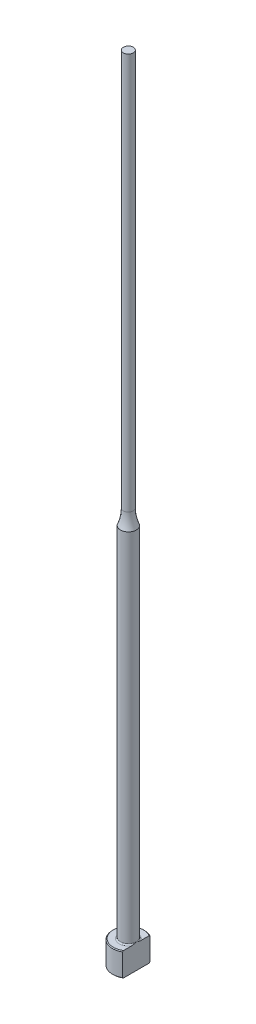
ISO-10303-21;
HEADER;
FILE_DESCRIPTION(('STEP AP214'),'2;1');
FILE_NAME('part.step','',(''),(''),'','','');
FILE_SCHEMA(('AUTOMOTIVE_DESIGN { 1 0 10303 214 1 1 1 1 }'));
ENDSEC;
DATA;
#1=APPLICATION_CONTEXT('core data for automotive mechanical design processes');
#2=APPLICATION_PROTOCOL_DEFINITION('international standard','automotive_design',2000,#1);
#3=PRODUCT_CONTEXT('',#1,'mechanical');
#4=PRODUCT('Part','Part','',(#3));
#5=PRODUCT_RELATED_PRODUCT_CATEGORY('part','',(#4));
#6=PRODUCT_DEFINITION_FORMATION('','',#4);
#7=PRODUCT_DEFINITION_CONTEXT('part definition',#1,'design');
#8=PRODUCT_DEFINITION('design','',#6,#7);
#9=PRODUCT_DEFINITION_SHAPE('','',#8);
#10=(LENGTH_UNIT() NAMED_UNIT(*) SI_UNIT(.MILLI.,.METRE.));
#11=(NAMED_UNIT(*) PLANE_ANGLE_UNIT() SI_UNIT($,.RADIAN.));
#12=(NAMED_UNIT(*) SI_UNIT($,.STERADIAN.) SOLID_ANGLE_UNIT());
#13=UNCERTAINTY_MEASURE_WITH_UNIT(LENGTH_MEASURE(1.E-05),#10,'distance_accuracy_value','');
#14=(GEOMETRIC_REPRESENTATION_CONTEXT(3) GLOBAL_UNCERTAINTY_ASSIGNED_CONTEXT((#13)) GLOBAL_UNIT_ASSIGNED_CONTEXT((#10,
#11,#12)) REPRESENTATION_CONTEXT('',''));
#15=CARTESIAN_POINT('',(0.,0.,0.));
#16=DIRECTION('',(0.,0.,1.));
#17=DIRECTION('',(1.,0.,0.));
#18=AXIS2_PLACEMENT_3D('',#15,#16,#17);
#19=CARTESIAN_POINT('',(-3.99999999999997,6.,0.));
#20=DIRECTION('',(0.,1.,0.));
#21=DIRECTION('',(0.,0.,1.));
#22=AXIS2_PLACEMENT_3D('',#19,#20,#21);
#23=PLANE('',#22);
#24=CARTESIAN_POINT('',(0.,6.,0.));
#25=DIRECTION('',(0.,1.,0.));
#26=DIRECTION('',(0.,0.,1.));
#27=AXIS2_PLACEMENT_3D('',#24,#25,#26);
#28=CIRCLE('',#27,3.80000000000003);
#29=CARTESIAN_POINT('',(1.99999999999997,6.,-3.23109888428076));
#30=VERTEX_POINT('',#29);
#31=CARTESIAN_POINT('',(1.99999999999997,6.,3.23109888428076));
#32=VERTEX_POINT('',#31);
#33=EDGE_CURVE('E187',#30,#32,#28,.T.);
#34=ORIENTED_EDGE('',*,*,#33,.T.);
#35=DIRECTION('',(0.,0.,-1.));
#36=VECTOR('',#35,1.);
#37=CARTESIAN_POINT('',(1.99999999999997,6.,0.));
#38=LINE('',#37,#36);
#39=CARTESIAN_POINT('',(1.99999999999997,5.99999999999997,1.13578166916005));
#40=VERTEX_POINT('',#39);
#41=EDGE_CURVE('E57',#32,#40,#38,.T.);
#42=ORIENTED_EDGE('',*,*,#41,.T.);
#43=CARTESIAN_POINT('',(0.,6.,0.));
#44=DIRECTION('',(0.,1.,0.));
#45=DIRECTION('',(0.,0.,1.));
#46=AXIS2_PLACEMENT_3D('',#43,#44,#45);
#47=CIRCLE('',#46,2.29999999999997);
#48=CARTESIAN_POINT('',(1.99999999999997,5.99999999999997,-1.13578166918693));
#49=VERTEX_POINT('',#48);
#50=EDGE_CURVE('E108',#40,#49,#47,.F.);
#51=ORIENTED_EDGE('',*,*,#50,.T.);
#52=EDGE_CURVE('E137',#49,#30,#38,.T.);
#53=ORIENTED_EDGE('',*,*,#52,.T.);
#54=EDGE_LOOP('',(#34,#42,#51,#53));
#55=FACE_BOUND('',#54,.T.);
#56=ADVANCED_FACE('F32',(#55),#23,.T.);
#57=CARTESIAN_POINT('',(0.,259.958771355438,0.));
#58=DIRECTION('',(0.,1.,0.));
#59=DIRECTION('',(0.,0.,1.));
#60=AXIS2_PLACEMENT_3D('',#57,#58,#59);
#61=CYLINDRICAL_SURFACE('',#60,3.99999999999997);
#62=CARTESIAN_POINT('',(0.,5.80000000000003,0.));
#63=DIRECTION('',(0.,1.,0.));
#64=DIRECTION('',(0.,0.,1.));
#65=AXIS2_PLACEMENT_3D('',#62,#63,#64);
#66=CIRCLE('',#65,3.99999999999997);
#67=CARTESIAN_POINT('',(1.99999999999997,5.80000000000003,3.46410161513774));
#68=VERTEX_POINT('',#67);
#69=CARTESIAN_POINT('',(1.99999999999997,5.80000000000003,-3.46410161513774));
#70=VERTEX_POINT('',#69);
#71=EDGE_CURVE('E105',#68,#70,#66,.F.);
#72=ORIENTED_EDGE('',*,*,#71,.T.);
#73=DIRECTION('',(0.,-1.,0.));
#74=VECTOR('',#73,1.);
#75=CARTESIAN_POINT('',(1.99999999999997,200.,-3.46410161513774));
#76=LINE('',#75,#74);
#77=CARTESIAN_POINT('',(1.99999999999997,0.199999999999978,-3.46410161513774));
#78=VERTEX_POINT('',#77);
#79=EDGE_CURVE('E193',#70,#78,#76,.T.);
#80=ORIENTED_EDGE('',*,*,#79,.T.);
#81=CARTESIAN_POINT('',(0.,0.199999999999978,0.));
#82=DIRECTION('',(0.,-1.,0.));
#83=DIRECTION('',(0.,0.,-1.));
#84=AXIS2_PLACEMENT_3D('',#81,#82,#83);
#85=CIRCLE('',#84,3.99999999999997);
#86=CARTESIAN_POINT('',(1.99999999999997,0.199999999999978,3.46410161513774));
#87=VERTEX_POINT('',#86);
#88=EDGE_CURVE('E100',#78,#87,#85,.F.);
#89=ORIENTED_EDGE('',*,*,#88,.T.);
#90=DIRECTION('',(0.,-1.,0.));
#91=VECTOR('',#90,1.);
#92=CARTESIAN_POINT('',(1.99999999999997,200.,3.46410161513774));
#93=LINE('',#92,#91);
#94=EDGE_CURVE('E93',#68,#87,#93,.T.);
#95=ORIENTED_EDGE('',*,*,#94,.F.);
#96=EDGE_LOOP('',(#72,#80,#89,#95));
#97=FACE_BOUND('',#96,.T.);
#98=ADVANCED_FACE('F158',(#97),#61,.T.);
#99=CARTESIAN_POINT('',(0.,0.,0.));
#100=DIRECTION('',(0.,-1.,0.));
#101=DIRECTION('',(0.,0.,-1.));
#102=AXIS2_PLACEMENT_3D('',#99,#100,#101);
#103=PLANE('',#102);
#104=CARTESIAN_POINT('',(0.,0.,0.));
#105=DIRECTION('',(0.,-1.,0.));
#106=DIRECTION('',(0.,0.,-1.));
#107=AXIS2_PLACEMENT_3D('',#104,#105,#106);
#108=CIRCLE('',#107,3.79999999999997);
#109=CARTESIAN_POINT('',(1.99999999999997,0.,3.23109888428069));
#110=VERTEX_POINT('',#109);
#111=CARTESIAN_POINT('',(1.99999999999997,0.,-3.23109888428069));
#112=VERTEX_POINT('',#111);
#113=EDGE_CURVE('E98',#110,#112,#108,.T.);
#114=ORIENTED_EDGE('',*,*,#113,.T.);
#115=DIRECTION('',(0.,0.,1.));
#116=VECTOR('',#115,1.);
#117=CARTESIAN_POINT('',(1.99999999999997,0.,3.46410161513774));
#118=LINE('',#117,#116);
#119=EDGE_CURVE('E83',#112,#110,#118,.T.);
#120=ORIENTED_EDGE('',*,*,#119,.T.);
#121=EDGE_LOOP('',(#114,#120));
#122=FACE_BOUND('',#121,.T.);
#123=ADVANCED_FACE('F103',(#122),#103,.T.);
#124=CARTESIAN_POINT('',(0.,6.00000000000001,0.));
#125=DIRECTION('',(0.,-1.,0.));
#126=DIRECTION('',(0.,0.,-1.));
#127=AXIS2_PLACEMENT_3D('',#124,#125,#126);
#128=CONICAL_SURFACE('',#127,3.80000000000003,0.785398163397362);
#129=ORIENTED_EDGE('',*,*,#71,.F.);
#130=CARTESIAN_POINT('',(1.99999999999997,1.91904532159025,7.62295524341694));
#131=CARTESIAN_POINT('',(1.99999999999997,2.08611243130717,7.4502239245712));
#132=CARTESIAN_POINT('',(1.99999999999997,2.25300024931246,7.27731861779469));
#133=CARTESIAN_POINT('',(1.99999999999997,2.58631125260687,6.93105655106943));
#134=CARTESIAN_POINT('',(1.99999999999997,2.75273443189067,6.75769978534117));
#135=CARTESIAN_POINT('',(1.99999999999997,3.08509080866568,6.41034692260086));
#136=CARTESIAN_POINT('',(1.99999999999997,3.25102371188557,6.23635054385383));
#137=CARTESIAN_POINT('',(1.99999999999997,3.58215598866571,5.88766284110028));
#138=CARTESIAN_POINT('',(1.99999999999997,3.74735536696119,5.71297152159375));
#139=CARTESIAN_POINT('',(1.99999999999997,4.0735385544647,5.36616839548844));
#140=CARTESIAN_POINT('',(1.99999999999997,4.23454099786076,5.19407412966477));
#141=CARTESIAN_POINT('',(1.99999999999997,4.55534102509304,4.84876663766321));
#142=CARTESIAN_POINT('',(1.99999999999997,4.71513861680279,4.67555341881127));
#143=CARTESIAN_POINT('',(1.99999999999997,5.0330618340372,4.32766569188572));
#144=CARTESIAN_POINT('',(1.99999999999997,5.191187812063,4.15299150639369));
#145=CARTESIAN_POINT('',(1.99999999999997,5.50513944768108,3.80159134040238));
#146=CARTESIAN_POINT('',(1.99999999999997,5.66096519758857,3.62486544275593));
#147=CARTESIAN_POINT('',(1.99999999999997,5.90974646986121,3.33722425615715));
#148=CARTESIAN_POINT('',(1.99999999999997,6.00376148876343,3.22722645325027));
#149=CARTESIAN_POINT('',(1.99999999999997,6.19011825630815,3.00579987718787));
#150=CARTESIAN_POINT('',(1.99999999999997,6.28245983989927,2.89437096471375));
#151=CARTESIAN_POINT('',(1.99999999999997,6.46586188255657,2.66849662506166));
#152=CARTESIAN_POINT('',(1.99999999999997,6.55689849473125,2.55403176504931));
#153=CARTESIAN_POINT('',(1.99999999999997,6.73578809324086,2.32266819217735));
#154=CARTESIAN_POINT('',(1.99999999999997,6.82364184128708,2.20577007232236));
#155=CARTESIAN_POINT('',(1.99999999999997,6.99612756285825,1.96688707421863));
#156=CARTESIAN_POINT('',(1.99999999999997,7.08069035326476,1.84485190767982));
#157=CARTESIAN_POINT('',(1.99999999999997,7.2430026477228,1.59599329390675));
#158=CARTESIAN_POINT('',(1.99999999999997,7.32074277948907,1.46916359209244));
#159=CARTESIAN_POINT('',(1.99999999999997,7.42869763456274,1.27510066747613));
#160=CARTESIAN_POINT('',(1.99999999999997,7.46305374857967,1.21018943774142));
#161=CARTESIAN_POINT('',(1.99999999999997,7.52837146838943,1.07868835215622));
#162=CARTESIAN_POINT('',(1.99999999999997,7.55933245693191,1.01209819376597));
#163=CARTESIAN_POINT('',(1.99999999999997,7.64566860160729,0.8098943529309));
#164=CARTESIAN_POINT('',(1.99999999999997,7.69478214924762,0.671360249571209));
#165=CARTESIAN_POINT('',(1.99999999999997,7.74794829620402,0.463657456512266));
#166=CARTESIAN_POINT('',(1.99999999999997,7.76205065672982,0.397033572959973));
#167=CARTESIAN_POINT('',(1.99999999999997,7.78390371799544,0.26272845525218));
#168=CARTESIAN_POINT('',(1.99999999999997,7.79165498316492,0.19504731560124));
#169=CARTESIAN_POINT('',(1.99999999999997,7.80025690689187,0.0594528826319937));
#170=CARTESIAN_POINT('',(1.99999999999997,7.80112894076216,-0.00845903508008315));
#171=CARTESIAN_POINT('',(1.99999999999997,7.79596585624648,-0.144020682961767));
#172=CARTESIAN_POINT('',(1.99999999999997,7.78993016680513,-0.211670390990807));
#173=CARTESIAN_POINT('',(1.99999999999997,7.77145363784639,-0.345483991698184));
#174=CARTESIAN_POINT('',(1.99999999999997,7.7590677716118,-0.411655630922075));
#175=CARTESIAN_POINT('',(1.99999999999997,7.72866360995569,-0.542678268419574));
#176=CARTESIAN_POINT('',(1.99999999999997,7.71064463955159,-0.607529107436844));
#177=CARTESIAN_POINT('',(1.99999999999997,7.669729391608,-0.736064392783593));
#178=CARTESIAN_POINT('',(1.99999999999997,7.64680564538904,-0.79973998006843));
#179=CARTESIAN_POINT('',(1.99999999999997,7.59700147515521,-0.925489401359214));
#180=CARTESIAN_POINT('',(1.99999999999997,7.57012185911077,-0.98756355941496));
#181=CARTESIAN_POINT('',(1.99999999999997,7.48443518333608,-1.17209020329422));
#182=CARTESIAN_POINT('',(1.99999999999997,7.42077407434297,-1.29228210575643));
#183=CARTESIAN_POINT('',(1.99999999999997,7.28502644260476,-1.52785770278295));
#184=CARTESIAN_POINT('',(1.99999999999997,7.21292931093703,-1.6432350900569));
#185=CARTESIAN_POINT('',(1.99999999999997,7.06281517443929,-1.8706938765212));
#186=CARTESIAN_POINT('',(1.99999999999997,6.98477595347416,-1.98276048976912));
#187=CARTESIAN_POINT('',(1.99999999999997,6.8248197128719,-2.20397837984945));
#188=CARTESIAN_POINT('',(1.99999999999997,6.74290465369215,-2.31313108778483));
#189=CARTESIAN_POINT('',(1.99999999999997,6.57517222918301,-2.5306854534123));
#190=CARTESIAN_POINT('',(1.99999999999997,6.4893176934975,-2.63905831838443));
#191=CARTESIAN_POINT('',(1.99999999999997,6.31548151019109,-2.85409686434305));
#192=CARTESIAN_POINT('',(1.99999999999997,6.22749963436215,-2.96076236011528));
#193=CARTESIAN_POINT('',(1.99999999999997,6.05015030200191,-3.17249211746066));
#194=CARTESIAN_POINT('',(1.99999999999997,5.96078672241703,-3.27755963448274));
#195=CARTESIAN_POINT('',(1.99999999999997,5.78082366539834,-3.48663191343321));
#196=CARTESIAN_POINT('',(1.99999999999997,5.69022416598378,-3.59063665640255));
#197=CARTESIAN_POINT('',(1.99999999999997,5.44796733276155,-3.86612439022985));
#198=CARTESIAN_POINT('',(1.99999999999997,5.29545972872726,-4.03685912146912));
#199=CARTESIAN_POINT('',(1.99999999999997,4.98858070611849,-4.37664803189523));
#200=CARTESIAN_POINT('',(1.99999999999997,4.83420923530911,-4.54570216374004));
#201=CARTESIAN_POINT('',(1.99999999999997,4.52396102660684,-4.88271638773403));
#202=CARTESIAN_POINT('',(1.99999999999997,4.36808300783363,-5.05067529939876));
#203=CARTESIAN_POINT('',(1.99999999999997,4.05530513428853,-5.38563883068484));
#204=CARTESIAN_POINT('',(1.99999999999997,3.8984052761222,-5.55264344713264));
#205=CARTESIAN_POINT('',(1.99999999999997,3.59029018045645,-5.87905385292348));
#206=CARTESIAN_POINT('',(1.99999999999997,3.43910664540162,-6.03848959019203));
#207=CARTESIAN_POINT('',(1.99999999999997,3.13616436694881,-6.35681456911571));
#208=CARTESIAN_POINT('',(1.99999999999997,2.98440562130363,-6.5157038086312));
#209=CARTESIAN_POINT('',(1.99999999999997,2.68059501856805,-6.83286192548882));
#210=CARTESIAN_POINT('',(1.99999999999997,2.52854367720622,-6.99113129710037));
#211=CARTESIAN_POINT('',(1.99999999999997,2.22406035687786,-7.30730102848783));
#212=CARTESIAN_POINT('',(1.99999999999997,2.07162838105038,-7.46520139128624));
#213=CARTESIAN_POINT('',(1.99999999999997,1.91904532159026,-7.62295524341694));
#214=B_SPLINE_CURVE_WITH_KNOTS('',3,(#130,#131,#132,#133,#134,#135,#136,#137,#138,#139,#140,
#141,#142,#143,#144,#145,#146,#147,#148,#149,#150,#151,#152,#153,#154,#155,#156,#157,#158,#159,
#160,#161,#162,#163,#164,#165,#166,#167,#168,#169,#170,#171,#172,#173,#174,#175,#176,#177,#178,
#179,#180,#181,#182,#183,#184,#185,#186,#187,#188,#189,#190,#191,#192,#193,#194,#195,#196,#197,
#198,#199,#200,#201,#202,#203,#204,#205,#206,#207,#208,#209,#210,#211,#212,#213),.UNSPECIFIED.,
.F.,.F.,(4,2,2,2,2,2,2,2,2,2,2,2,2,2,2,2,2,2,2,2,2,2,2,2,2,2,2,2,2,2,2,2,2,2,2,2,2,2,2,2,2,4),
(0.,0.720921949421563,1.4418531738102,2.16315326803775,2.8844486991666,3.59144103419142,
4.29842874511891,5.00526427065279,5.7120713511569,6.14616174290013,6.58029471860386,
7.01901494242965,7.45762947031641,7.90290456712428,8.34878206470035,8.56901415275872,
8.78928621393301,9.228144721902,9.43219512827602,9.63622739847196,9.83962544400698,
10.0430403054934,10.244723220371,10.4464303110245,10.6492980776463,10.8521244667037,
11.2595582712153,11.6675100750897,12.0770700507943,12.4864250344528,12.9011677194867,
13.3159550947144,13.7297367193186,14.1435257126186,14.8302935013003,15.5170805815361,
16.2045145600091,16.891950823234,17.5511045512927,18.2102608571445,18.8686819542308,
19.5270976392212),.UNSPECIFIED.);
#215=EDGE_CURVE('E136',#68,#32,#214,.T.);
#216=ORIENTED_EDGE('',*,*,#215,.T.);
#217=ORIENTED_EDGE('',*,*,#33,.F.);
#218=EDGE_CURVE('E128',#30,#70,#214,.T.);
#219=ORIENTED_EDGE('',*,*,#218,.T.);
#220=EDGE_LOOP('',(#129,#216,#217,#219));
#221=FACE_BOUND('',#220,.T.);
#222=ADVANCED_FACE('F144',(#221),#128,.T.);
#223=CARTESIAN_POINT('',(0.,0.199999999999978,0.));
#224=DIRECTION('',(0.,1.,0.));
#225=DIRECTION('',(0.,0.,1.));
#226=AXIS2_PLACEMENT_3D('',#223,#224,#225);
#227=CONICAL_SURFACE('',#226,3.99999999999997,0.7853981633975);
#228=ORIENTED_EDGE('',*,*,#88,.F.);
#229=CARTESIAN_POINT('',(1.99999999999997,4.08095467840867,-7.62295524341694));
#230=CARTESIAN_POINT('',(1.99999999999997,3.91388756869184,-7.45022392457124));
#231=CARTESIAN_POINT('',(1.99999999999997,3.74699975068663,-7.27731861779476));
#232=CARTESIAN_POINT('',(1.99999999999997,3.41368874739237,-6.93105655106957));
#233=CARTESIAN_POINT('',(1.99999999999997,3.24726556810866,-6.75769978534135));
#234=CARTESIAN_POINT('',(1.99999999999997,2.91490919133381,-6.4103469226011));
#235=CARTESIAN_POINT('',(1.99999999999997,2.74897628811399,-6.23635054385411));
#236=CARTESIAN_POINT('',(1.99999999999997,2.41784401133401,-5.88766284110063));
#237=CARTESIAN_POINT('',(1.99999999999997,2.25264463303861,-5.71297152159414));
#238=CARTESIAN_POINT('',(1.99999999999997,1.92646144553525,-5.3661683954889));
#239=CARTESIAN_POINT('',(1.99999999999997,1.76545900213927,-5.19407412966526));
#240=CARTESIAN_POINT('',(1.99999999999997,1.44465897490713,-4.84876663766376));
#241=CARTESIAN_POINT('',(1.99999999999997,1.28486138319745,-4.67555341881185));
#242=CARTESIAN_POINT('',(1.99999999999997,0.966938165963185,-4.32766569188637));
#243=CARTESIAN_POINT('',(1.99999999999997,0.80881218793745,-4.15299150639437));
#244=CARTESIAN_POINT('',(1.99999999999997,0.494860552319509,-3.80159134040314));
#245=CARTESIAN_POINT('',(1.99999999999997,0.339034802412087,-3.62486544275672));
#246=CARTESIAN_POINT('',(1.99999999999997,0.0902535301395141,-3.33722425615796));
#247=CARTESIAN_POINT('',(1.99999999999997,-0.0037614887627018,-3.22722645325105));
#248=CARTESIAN_POINT('',(1.99999999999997,-0.190118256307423,-3.0057998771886));
#249=CARTESIAN_POINT('',(1.99999999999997,-0.282459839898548,-2.89437096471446));
#250=CARTESIAN_POINT('',(1.99999999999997,-0.465861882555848,-2.66849662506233));
#251=CARTESIAN_POINT('',(1.99999999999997,-0.556898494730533,-2.55403176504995));
#252=CARTESIAN_POINT('',(1.99999999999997,-0.735788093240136,-2.32266819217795));
#253=CARTESIAN_POINT('',(1.99999999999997,-0.823641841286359,-2.20577007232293));
#254=CARTESIAN_POINT('',(1.99999999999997,-0.996127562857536,-1.96688707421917));
#255=CARTESIAN_POINT('',(1.99999999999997,-1.08069035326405,-1.84485190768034));
#256=CARTESIAN_POINT('',(1.99999999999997,-1.2430026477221,-1.59599329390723));
#257=CARTESIAN_POINT('',(1.99999999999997,-1.32074277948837,-1.4691635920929));
#258=CARTESIAN_POINT('',(1.99999999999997,-1.42869763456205,-1.27510066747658));
#259=CARTESIAN_POINT('',(1.99999999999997,-1.46305374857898,-1.21018943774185));
#260=CARTESIAN_POINT('',(1.99999999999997,-1.52837146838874,-1.07868835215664));
#261=CARTESIAN_POINT('',(1.99999999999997,-1.55933245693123,-1.01209819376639));
#262=CARTESIAN_POINT('',(1.99999999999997,-1.64566860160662,-0.809894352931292));
#263=CARTESIAN_POINT('',(1.99999999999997,-1.69478214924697,-0.671360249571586));
#264=CARTESIAN_POINT('',(1.99999999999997,-1.74794829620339,-0.463657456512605));
#265=CARTESIAN_POINT('',(1.99999999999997,-1.76205065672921,-0.397033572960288));
#266=CARTESIAN_POINT('',(1.99999999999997,-1.78390371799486,-0.262728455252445));
#267=CARTESIAN_POINT('',(1.99999999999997,-1.79165498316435,-0.19504731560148));
#268=CARTESIAN_POINT('',(1.99999999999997,-1.80025690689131,-0.059452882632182));
#269=CARTESIAN_POINT('',(1.99999999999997,-1.8011289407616,0.00845903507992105));
#270=CARTESIAN_POINT('',(1.99999999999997,-1.79596585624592,0.144020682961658));
#271=CARTESIAN_POINT('',(1.99999999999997,-1.78993016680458,0.211670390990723));
#272=CARTESIAN_POINT('',(1.99999999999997,-1.77145363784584,0.345483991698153));
#273=CARTESIAN_POINT('',(1.99999999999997,-1.75906777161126,0.411655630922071));
#274=CARTESIAN_POINT('',(1.99999999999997,-1.72866360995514,0.542678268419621));
#275=CARTESIAN_POINT('',(1.99999999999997,-1.71064463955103,0.607529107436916));
#276=CARTESIAN_POINT('',(1.99999999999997,-1.66972939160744,0.736064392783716));
#277=CARTESIAN_POINT('',(1.99999999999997,-1.64680564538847,0.799739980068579));
#278=CARTESIAN_POINT('',(1.99999999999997,-1.59700147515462,0.925489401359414));
#279=CARTESIAN_POINT('',(1.99999999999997,-1.57012185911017,0.987563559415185));
#280=CARTESIAN_POINT('',(1.99999999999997,-1.48443518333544,1.17209020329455));
#281=CARTESIAN_POINT('',(1.99999999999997,-1.4207740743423,1.29228210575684));
#282=CARTESIAN_POINT('',(1.99999999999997,-1.28502644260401,1.52785770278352));
#283=CARTESIAN_POINT('',(1.99999999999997,-1.21292931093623,1.64323509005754));
#284=CARTESIAN_POINT('',(1.99999999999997,-1.0628151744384,1.87069387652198));
#285=CARTESIAN_POINT('',(1.99999999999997,-0.984775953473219,1.98276048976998));
#286=CARTESIAN_POINT('',(1.99999999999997,-0.82481971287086,2.20397837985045));
#287=CARTESIAN_POINT('',(1.99999999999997,-0.742904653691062,2.31313108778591));
#288=CARTESIAN_POINT('',(1.99999999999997,-0.575172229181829,2.53068545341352));
#289=CARTESIAN_POINT('',(1.99999999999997,-0.489317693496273,2.63905831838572));
#290=CARTESIAN_POINT('',(1.99999999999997,-0.315481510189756,2.85409686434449));
#291=CARTESIAN_POINT('',(1.99999999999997,-0.227499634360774,2.9607623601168));
#292=CARTESIAN_POINT('',(1.99999999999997,-0.0501503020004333,3.17249211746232));
#293=CARTESIAN_POINT('',(1.99999999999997,0.0392132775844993,3.27755963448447));
#294=CARTESIAN_POINT('',(1.99999999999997,0.219176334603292,3.48663191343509));
#295=CARTESIAN_POINT('',(1.99999999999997,0.309775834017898,3.59063665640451));
#296=CARTESIAN_POINT('',(1.99999999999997,0.552032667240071,3.86612439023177));
#297=CARTESIAN_POINT('',(1.99999999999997,0.704540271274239,4.03685912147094));
#298=CARTESIAN_POINT('',(1.99999999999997,1.01141929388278,4.37664803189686));
#299=CARTESIAN_POINT('',(1.99999999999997,1.16579076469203,4.54570216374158));
#300=CARTESIAN_POINT('',(1.99999999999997,1.47603897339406,4.88271638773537));
#301=CARTESIAN_POINT('',(1.99999999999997,1.63191699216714,5.05067529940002));
#302=CARTESIAN_POINT('',(1.99999999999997,1.94469486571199,5.38563883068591));
#303=CARTESIAN_POINT('',(1.99999999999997,2.10159472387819,5.55264344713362));
#304=CARTESIAN_POINT('',(1.99999999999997,2.40970981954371,5.87905385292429));
#305=CARTESIAN_POINT('',(1.99999999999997,2.56089335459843,6.03848959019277));
#306=CARTESIAN_POINT('',(1.99999999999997,2.86383563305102,6.3568145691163));
#307=CARTESIAN_POINT('',(1.99999999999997,3.01559437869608,6.51570380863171));
#308=CARTESIAN_POINT('',(1.99999999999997,3.31940498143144,6.83286192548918));
#309=CARTESIAN_POINT('',(1.99999999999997,3.47145632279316,6.99113129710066));
#310=CARTESIAN_POINT('',(1.99999999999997,3.77593964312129,7.30730102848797));
#311=CARTESIAN_POINT('',(1.99999999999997,3.92837161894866,7.46520139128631));
#312=CARTESIAN_POINT('',(1.99999999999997,4.08095467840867,7.62295524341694));
#313=B_SPLINE_CURVE_WITH_KNOTS('',3,(#229,#230,#231,#232,#233,#234,#235,#236,#237,#238,#239,
#240,#241,#242,#243,#244,#245,#246,#247,#248,#249,#250,#251,#252,#253,#254,#255,#256,#257,#258,
#259,#260,#261,#262,#263,#264,#265,#266,#267,#268,#269,#270,#271,#272,#273,#274,#275,#276,#277,
#278,#279,#280,#281,#282,#283,#284,#285,#286,#287,#288,#289,#290,#291,#292,#293,#294,#295,#296,
#297,#298,#299,#300,#301,#302,#303,#304,#305,#306,#307,#308,#309,#310,#311,#312),.UNSPECIFIED.,
.F.,.F.,(4,2,2,2,2,2,2,2,2,2,2,2,2,2,2,2,2,2,2,2,2,2,2,2,2,2,2,2,2,2,2,2,2,2,2,2,2,2,2,2,2,4),
(0.,0.720921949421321,1.44185317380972,2.16315326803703,2.88444869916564,3.59144103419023,
4.29842874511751,5.00526427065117,5.71207135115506,6.14616174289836,6.58029471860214,
7.01901494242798,7.45762947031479,7.90290456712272,8.34878206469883,8.56901415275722,
8.78928621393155,9.22814472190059,9.43219512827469,9.63622739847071,9.8396254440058,
10.0430403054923,10.24472322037,10.4464303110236,10.6492980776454,10.8521244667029,
11.2595582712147,11.6675100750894,12.0770700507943,12.4864250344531,12.9011677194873,
13.3159550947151,13.7297367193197,14.1435257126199,14.8302935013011,15.5170805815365,
16.204514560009,16.8919508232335,17.5511045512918,18.2102608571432,18.8686819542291,
19.5270976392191),.UNSPECIFIED.);
#314=EDGE_CURVE('E86',#78,#112,#313,.T.);
#315=ORIENTED_EDGE('',*,*,#314,.T.);
#316=ORIENTED_EDGE('',*,*,#113,.F.);
#317=EDGE_CURVE('E89',#110,#87,#313,.T.);
#318=ORIENTED_EDGE('',*,*,#317,.T.);
#319=EDGE_LOOP('',(#228,#315,#316,#318));
#320=FACE_BOUND('',#319,.T.);
#321=ADVANCED_FACE('F97',(#320),#227,.T.);
#322=CARTESIAN_POINT('',(0.,6.29999999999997,0.));
#323=DIRECTION('',(0.,1.,0.));
#324=DIRECTION('',(0.,0.,1.));
#325=AXIS2_PLACEMENT_3D('',#322,#323,#324);
#326=TOROIDAL_SURFACE('',#325,2.29999999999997,0.3);
#327=CARTESIAN_POINT('',(1.99999999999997,6.29999999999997,0.));
#328=CARTESIAN_POINT('',(1.99999999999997,6.30000062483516,-7.91120119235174E-11));
#329=CARTESIAN_POINT('',(1.99999999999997,6.3000012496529,-1.38466953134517E-07));
#330=CARTESIAN_POINT('',(1.99999999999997,6.3000024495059,-5.72507056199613E-07));
#331=CARTESIAN_POINT('',(1.99999999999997,6.30000302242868,-8.72848936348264E-07));
#332=CARTESIAN_POINT('',(1.99999999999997,6.30000416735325,-1.59335938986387E-06));
#333=CARTESIAN_POINT('',(1.99999999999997,6.30000473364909,-2.02244692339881E-06));
#334=CARTESIAN_POINT('',(1.99999999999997,6.30000579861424,-2.94494844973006E-06));
#335=CARTESIAN_POINT('',(1.99999999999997,6.30000629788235,-3.4377030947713E-06));
#336=CARTESIAN_POINT('',(1.99999999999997,6.30000798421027,-5.21460072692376E-06));
#337=CARTESIAN_POINT('',(1.99999999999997,6.30000908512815,-6.58180911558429E-06));
#338=CARTESIAN_POINT('',(1.99999999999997,6.30001103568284,-9.3977532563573E-06));
#339=CARTESIAN_POINT('',(1.99999999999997,6.30001189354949,-1.08411101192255E-05));
#340=CARTESIAN_POINT('',(1.99999999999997,6.30001514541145,-1.65122775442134E-05));
#341=CARTESIAN_POINT('',(1.99999999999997,6.30001737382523,-2.08398783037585E-05));
#342=CARTESIAN_POINT('',(1.99999999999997,6.30002099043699,-2.93440763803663E-05));
#343=CARTESIAN_POINT('',(1.99999999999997,6.30002243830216,-3.34960297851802E-05));
#344=CARTESIAN_POINT('',(1.99999999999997,6.30002863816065,-5.12890573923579E-05));
#345=CARTESIAN_POINT('',(1.99999999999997,6.30003337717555,-6.49250938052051E-05));
#346=CARTESIAN_POINT('',(1.99999999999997,6.30004093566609,-9.03829827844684E-05));
#347=CARTESIAN_POINT('',(1.99999999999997,6.30004394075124,-0.000102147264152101));
#348=CARTESIAN_POINT('',(1.99999999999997,6.30006787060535,-0.000188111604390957));
#349=CARTESIAN_POINT('',(1.99999999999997,6.3000985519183,-0.000259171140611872));
#350=CARTESIAN_POINT('',(1.99999999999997,6.30021378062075,-0.00053614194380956));
#351=CARTESIAN_POINT('',(1.99999999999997,6.3002910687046,-0.000744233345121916));
#352=CARTESIAN_POINT('',(1.99999999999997,6.30059644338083,-0.00155446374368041));
#353=CARTESIAN_POINT('',(1.99999999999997,6.30083214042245,-0.00215436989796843));
#354=CARTESIAN_POINT('',(1.99999999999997,6.30179425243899,-0.00461477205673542));
#355=CARTESIAN_POINT('',(1.99999999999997,6.30251207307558,-0.00647773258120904));
#356=CARTESIAN_POINT('',(1.99999999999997,6.31311632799,-0.0339840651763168));
#357=CARTESIAN_POINT('',(1.99999999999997,6.32306890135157,-0.0596088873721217));
#358=CARTESIAN_POINT('',(1.99999999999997,6.34248629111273,-0.109946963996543));
#359=CARTESIAN_POINT('',(1.99999999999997,6.35195547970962,-0.134658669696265));
#360=CARTESIAN_POINT('',(1.99999999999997,6.37186796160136,-0.18704653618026));
#361=CARTESIAN_POINT('',(1.99999999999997,6.38229466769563,-0.214729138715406));
#362=CARTESIAN_POINT('',(1.99999999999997,6.40297705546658,-0.270480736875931));
#363=CARTESIAN_POINT('',(1.99999999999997,6.41322989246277,-0.298550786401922));
#364=CARTESIAN_POINT('',(1.99999999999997,6.43806738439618,-0.36800773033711));
#365=CARTESIAN_POINT('',(1.99999999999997,6.45243182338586,-0.409474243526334));
#366=CARTESIAN_POINT('',(1.99999999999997,6.47965482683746,-0.491807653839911));
#367=CARTESIAN_POINT('',(1.99999999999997,6.49254110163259,-0.532665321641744));
#368=CARTESIAN_POINT('',(1.99999999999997,6.51851192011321,-0.620554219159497));
#369=CARTESIAN_POINT('',(1.99999999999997,6.53137383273,-0.667652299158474));
#370=CARTESIAN_POINT('',(1.99999999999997,6.55459547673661,-0.762854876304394));
#371=CARTESIAN_POINT('',(1.99999999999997,6.5649353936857,-0.810964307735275));
#372=CARTESIAN_POINT('',(1.99999999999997,6.58270957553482,-0.910933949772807));
#373=CARTESIAN_POINT('',(1.99999999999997,6.58991426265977,-0.962836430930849));
#374=CARTESIAN_POINT('',(1.99999999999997,6.59906919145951,-1.06698400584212));
#375=CARTESIAN_POINT('',(1.99999999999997,6.60103790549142,-1.1192272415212));
#376=CARTESIAN_POINT('',(1.99999999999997,6.59819318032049,-1.21399009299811));
#377=CARTESIAN_POINT('',(1.99999999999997,6.59455548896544,-1.2565387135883));
#378=CARTESIAN_POINT('',(1.99999999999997,6.58116512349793,-1.34017723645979));
#379=CARTESIAN_POINT('',(1.99999999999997,6.57150205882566,-1.38127935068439));
#380=CARTESIAN_POINT('',(1.99999999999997,6.55087659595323,-1.44109771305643));
#381=CARTESIAN_POINT('',(1.99999999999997,6.5429124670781,-1.46084510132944));
#382=CARTESIAN_POINT('',(1.99999999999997,6.52453399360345,-1.49924523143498));
#383=CARTESIAN_POINT('',(1.99999999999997,6.51411538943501,-1.51789599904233));
#384=CARTESIAN_POINT('',(1.99999999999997,6.49255299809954,-1.55022658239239));
#385=CARTESIAN_POINT('',(1.99999999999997,6.48185951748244,-1.56420357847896));
#386=CARTESIAN_POINT('',(1.99999999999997,6.45839348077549,-1.5902875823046));
#387=CARTESIAN_POINT('',(1.99999999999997,6.445625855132,-1.60239889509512));
#388=CARTESIAN_POINT('',(1.99999999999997,6.4218327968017,-1.62093425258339));
#389=CARTESIAN_POINT('',(1.99999999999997,6.41131183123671,-1.6280029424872));
#390=CARTESIAN_POINT('',(1.99999999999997,6.38926242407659,-1.64036132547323));
#391=CARTESIAN_POINT('',(1.99999999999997,6.37773458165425,-1.64565206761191));
#392=CARTESIAN_POINT('',(1.99999999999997,6.35379760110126,-1.65410966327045));
#393=CARTESIAN_POINT('',(1.99999999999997,6.34138166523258,-1.65725762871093));
#394=CARTESIAN_POINT('',(1.99999999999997,6.31617371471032,-1.66106000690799));
#395=CARTESIAN_POINT('',(1.99999999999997,6.3033820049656,-1.66171638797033));
#396=CARTESIAN_POINT('',(1.99999999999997,6.27959278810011,-1.66055848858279));
#397=CARTESIAN_POINT('',(1.99999999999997,6.26857876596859,-1.6590551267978));
#398=CARTESIAN_POINT('',(1.99999999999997,6.24695777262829,-1.65423593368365));
#399=CARTESIAN_POINT('',(1.99999999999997,6.23635086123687,-1.65091983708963));
#400=CARTESIAN_POINT('',(1.99999999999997,6.21566894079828,-1.64264699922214));
#401=CARTESIAN_POINT('',(1.99999999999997,6.20560117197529,-1.63767239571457));
#402=CARTESIAN_POINT('',(1.99999999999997,6.18626855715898,-1.626364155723));
#403=CARTESIAN_POINT('',(1.99999999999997,6.17700400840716,-1.62003001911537));
#404=CARTESIAN_POINT('',(1.99999999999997,6.15429988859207,-1.60233802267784));
#405=CARTESIAN_POINT('',(1.99999999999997,6.14148777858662,-1.59017362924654));
#406=CARTESIAN_POINT('',(1.99999999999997,6.11794267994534,-1.56396532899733));
#407=CARTESIAN_POINT('',(1.99999999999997,6.10721625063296,-1.54991572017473));
#408=CARTESIAN_POINT('',(1.99999999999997,6.08234423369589,-1.51253200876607));
#409=CARTESIAN_POINT('',(1.99999999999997,6.06952968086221,-1.48831711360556));
#410=CARTESIAN_POINT('',(1.99999999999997,6.04773953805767,-1.43832020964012));
#411=CARTESIAN_POINT('',(1.99999999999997,6.03876197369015,-1.41253901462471));
#412=CARTESIAN_POINT('',(1.99999999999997,6.01850750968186,-1.3410181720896));
#413=CARTESIAN_POINT('',(1.99999999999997,6.01031623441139,-1.29441496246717));
#414=CARTESIAN_POINT('',(1.99999999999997,6.00061264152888,-1.19993212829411));
#415=CARTESIAN_POINT('',(1.99999999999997,5.99920833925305,-1.15204398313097));
#416=CARTESIAN_POINT('',(1.99999999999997,6.001930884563,-1.04246961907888));
#417=CARTESIAN_POINT('',(1.99999999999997,6.00779200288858,-0.980836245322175));
#418=CARTESIAN_POINT('',(1.99999999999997,6.0256292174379,-0.858294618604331));
#419=CARTESIAN_POINT('',(1.99999999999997,6.03763032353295,-0.797390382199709));
#420=CARTESIAN_POINT('',(1.99999999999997,6.0649490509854,-0.681046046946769));
#421=CARTESIAN_POINT('',(1.99999999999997,6.07996031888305,-0.625531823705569));
#422=CARTESIAN_POINT('',(1.99999999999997,6.11250087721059,-0.515805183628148));
#423=CARTESIAN_POINT('',(1.99999999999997,6.13000629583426,-0.461585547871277));
#424=CARTESIAN_POINT('',(1.99999999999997,6.15814737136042,-0.379074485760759));
#425=CARTESIAN_POINT('',(1.99999999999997,6.16814918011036,-0.350562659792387));
#426=CARTESIAN_POINT('',(1.99999999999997,6.18879761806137,-0.29295407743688));
#427=CARTESIAN_POINT('',(1.99999999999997,6.19945417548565,-0.263860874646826));
#428=CARTESIAN_POINT('',(1.99999999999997,6.21767622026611,-0.214869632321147));
#429=CARTESIAN_POINT('',(1.99999999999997,6.22516548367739,-0.19494302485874));
#430=CARTESIAN_POINT('',(1.99999999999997,6.24017206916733,-0.155327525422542));
#431=CARTESIAN_POINT('',(1.99999999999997,6.24768836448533,-0.135638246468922));
#432=CARTESIAN_POINT('',(1.99999999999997,6.26198776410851,-0.0983447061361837));
#433=CARTESIAN_POINT('',(1.99999999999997,6.26876515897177,-0.0807381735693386));
#434=CARTESIAN_POINT('',(1.99999999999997,6.2826325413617,-0.0448719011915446));
#435=CARTESIAN_POINT('',(1.99999999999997,6.28972459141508,-0.0266128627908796));
#436=CARTESIAN_POINT('',(1.99999999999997,6.29748742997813,-0.0064792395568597));
#437=CARTESIAN_POINT('',(1.99999999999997,6.29820461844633,-0.00461774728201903));
#438=CARTESIAN_POINT('',(1.99999999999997,6.29916656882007,-0.00215769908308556));
#439=CARTESIAN_POINT('',(1.99999999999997,6.29940270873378,-0.0015566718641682));
#440=CARTESIAN_POINT('',(1.99999999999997,6.29970861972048,-0.000745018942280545));
#441=CARTESIAN_POINT('',(1.99999999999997,6.29978601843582,-0.000536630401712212));
#442=CARTESIAN_POINT('',(1.99999999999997,6.29990139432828,-0.000259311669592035));
#443=CARTESIAN_POINT('',(1.99999999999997,6.29993209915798,-0.000188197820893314));
#444=CARTESIAN_POINT('',(1.99999999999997,6.29995604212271,-0.00010217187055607));
#445=CARTESIAN_POINT('',(1.99999999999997,6.29995904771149,-9.04035945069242E-05));
#446=CARTESIAN_POINT('',(1.99999999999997,6.29996660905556,-6.49368762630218E-05));
#447=CARTESIAN_POINT('',(1.99999999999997,6.2999713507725,-5.12961131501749E-05));
#448=CARTESIAN_POINT('',(1.99999999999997,6.29997755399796,-3.34977849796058E-05));
#449=CARTESIAN_POINT('',(1.99999999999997,6.29997900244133,-2.93452179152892E-05));
#450=CARTESIAN_POINT('',(1.99999999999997,6.29998262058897,-2.08398568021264E-05));
#451=CARTESIAN_POINT('',(1.99999999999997,6.2999848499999,-1.65117298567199E-05));
#452=CARTESIAN_POINT('',(1.99999999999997,6.29998810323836,-1.08400636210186E-05));
#453=CARTESIAN_POINT('',(1.99999999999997,6.29998896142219,-9.39665904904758E-06));
#454=CARTESIAN_POINT('',(1.99999999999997,6.29999091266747,-6.58068188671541E-06));
#455=CARTESIAN_POINT('',(1.99999999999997,6.29999201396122,-5.21349162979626E-06));
#456=CARTESIAN_POINT('',(1.99999999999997,6.29999370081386,-3.43669337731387E-06));
#457=CARTESIAN_POINT('',(1.99999999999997,6.29999420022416,-2.94398228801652E-06));
#458=CARTESIAN_POINT('',(1.99999999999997,6.29999526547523,-2.02159337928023E-06));
#459=CARTESIAN_POINT('',(1.99999999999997,6.29999583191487,-1.59257522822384E-06));
#460=CARTESIAN_POINT('',(1.99999999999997,6.29999697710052,-8.72232367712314E-07));
#461=CARTESIAN_POINT('',(1.99999999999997,6.29999755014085,-5.71985037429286E-07));
#462=CARTESIAN_POINT('',(1.99999999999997,6.29999875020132,-1.38175023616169E-07));
#463=CARTESIAN_POINT('',(1.99999999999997,6.29999937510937,7.91190278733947E-11));
#464=CARTESIAN_POINT('',(1.99999999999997,6.29999999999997,0.));
#465=B_SPLINE_CURVE_WITH_KNOTS('',3,(#327,#328,#329,#330,#331,#332,#333,#334,#335,#336,#337,
#338,#339,#340,#341,#342,#343,#344,#345,#346,#347,#348,#349,#350,#351,#352,#353,#354,#355,#356,
#357,#358,#359,#360,#361,#362,#363,#364,#365,#366,#367,#368,#369,#370,#371,#372,#373,#374,#375,
#376,#377,#378,#379,#380,#381,#382,#383,#384,#385,#386,#387,#388,#389,#390,#391,#392,#393,#394,
#395,#396,#397,#398,#399,#400,#401,#402,#403,#404,#405,#406,#407,#408,#409,#410,#411,#412,#413,
#414,#415,#416,#417,#418,#419,#420,#421,#422,#423,#424,#425,#426,#427,#428,#429,#430,#431,#432,
#433,#434,#435,#436,#437,#438,#439,#440,#441,#442,#443,#444,#445,#446,#447,#448,#449,#450,#451,
#452,#453,#454,#455,#456,#457,#458,#459,#460,#461,#462,#463,#464),.UNSPECIFIED.,.T.,.F.,(4,2,2,
2,2,2,2,2,2,2,2,2,2,2,2,2,2,2,2,2,2,2,2,2,2,2,2,2,2,2,2,2,2,2,2,2,2,2,2,2,2,2,2,2,2,2,2,2,2,2,2,
2,2,2,2,2,2,2,2,2,2,2,2,2,2,2,2,2,4),(0.,1.87392281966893E-06,3.80527467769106E-06,
5.92782295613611E-06,8.02992841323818E-06,1.32707961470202E-05,1.83039487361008E-05,
3.28629525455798E-05,4.60403129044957E-05,8.93409891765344E-05,0.000125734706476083,
0.000357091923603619,0.00102372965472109,0.00295649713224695,0.00894682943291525,
0.0914075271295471,0.170800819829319,0.259542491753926,0.349192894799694,0.480831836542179,
0.609336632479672,0.755749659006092,0.90327840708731,1.06029304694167,1.2167530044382,
1.34456674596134,1.47052354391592,1.53427785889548,1.59814364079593,1.65076980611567,
1.70327265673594,1.74115950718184,1.7790239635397,1.81721800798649,1.85538187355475,
1.88857073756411,1.92176445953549,1.95532789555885,1.98890369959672,2.04160283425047,
2.09446511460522,2.17619131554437,2.25787541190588,2.39903747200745,2.54243890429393,
2.72770087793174,2.91372355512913,3.08615579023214,3.2570365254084,3.34768022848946,
3.44062797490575,3.50449043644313,3.56771526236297,3.62431442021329,3.68307253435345,
3.68905809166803,3.69099447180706,3.69166206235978,3.69189359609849,3.69193000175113,
3.69197331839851,3.69198649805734,3.69200105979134,3.69200609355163,3.69201133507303,
3.69201343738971,3.69201556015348,3.69201749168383,3.69201936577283),.UNSPECIFIED.);
#466=CARTESIAN_POINT('',(1.99999999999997,6.29999999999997,0.));
#467=VERTEX_POINT('',#466);
#468=EDGE_CURVE('E11',#49,#467,#465,.T.);
#469=ORIENTED_EDGE('',*,*,#468,.F.);
#470=ORIENTED_EDGE('',*,*,#50,.F.);
#471=CARTESIAN_POINT('',(1.99999999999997,6.29999999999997,0.));
#472=CARTESIAN_POINT('',(1.99999999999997,6.29999937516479,7.91119678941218E-11));
#473=CARTESIAN_POINT('',(1.99999999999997,6.29999875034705,1.38466953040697E-07));
#474=CARTESIAN_POINT('',(1.99999999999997,6.29999755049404,5.72507056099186E-07));
#475=CARTESIAN_POINT('',(1.99999999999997,6.29999697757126,8.72848936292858E-07));
#476=CARTESIAN_POINT('',(1.99999999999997,6.29999583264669,1.5933593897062E-06));
#477=CARTESIAN_POINT('',(1.99999999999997,6.29999526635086,2.02244692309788E-06));
#478=CARTESIAN_POINT('',(1.99999999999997,6.29999420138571,2.94494844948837E-06));
#479=CARTESIAN_POINT('',(1.99999999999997,6.29999370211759,3.43770309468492E-06));
#480=CARTESIAN_POINT('',(1.99999999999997,6.29999201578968,5.2146007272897E-06));
#481=CARTESIAN_POINT('',(1.99999999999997,6.29999091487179,6.58180911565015E-06));
#482=CARTESIAN_POINT('',(1.99999999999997,6.29998896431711,9.39775325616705E-06));
#483=CARTESIAN_POINT('',(1.99999999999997,6.29998810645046,1.08411101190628E-05));
#484=CARTESIAN_POINT('',(1.99999999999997,6.2999848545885,1.65122775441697E-05));
#485=CARTESIAN_POINT('',(1.99999999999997,6.29998262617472,2.08398783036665E-05));
#486=CARTESIAN_POINT('',(1.99999999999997,6.29997900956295,2.93440763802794E-05));
#487=CARTESIAN_POINT('',(1.99999999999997,6.29997756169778,3.34960297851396E-05));
#488=CARTESIAN_POINT('',(1.99999999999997,6.2999713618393,5.12890573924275E-05));
#489=CARTESIAN_POINT('',(1.99999999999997,6.2999666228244,6.49250938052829E-05));
#490=CARTESIAN_POINT('',(1.99999999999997,6.29995906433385,9.03829827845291E-05));
#491=CARTESIAN_POINT('',(1.99999999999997,6.2999560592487,0.000102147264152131));
#492=CARTESIAN_POINT('',(1.99999999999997,6.29993212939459,0.000188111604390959));
#493=CARTESIAN_POINT('',(1.99999999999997,6.29990144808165,0.000259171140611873));
#494=CARTESIAN_POINT('',(1.99999999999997,6.2997862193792,0.000536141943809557));
#495=CARTESIAN_POINT('',(1.99999999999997,6.29970893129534,0.000744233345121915));
#496=CARTESIAN_POINT('',(1.99999999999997,6.29940355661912,0.00155446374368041));
#497=CARTESIAN_POINT('',(1.99999999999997,6.29916785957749,0.00215436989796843));
#498=CARTESIAN_POINT('',(1.99999999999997,6.29820574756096,0.00461477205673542));
#499=CARTESIAN_POINT('',(1.99999999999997,6.29748792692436,0.00647773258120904));
#500=CARTESIAN_POINT('',(1.99999999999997,6.28688367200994,0.0339840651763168));
#501=CARTESIAN_POINT('',(1.99999999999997,6.27693109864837,0.0596088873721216));
#502=CARTESIAN_POINT('',(1.99999999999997,6.25751370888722,0.109946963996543));
#503=CARTESIAN_POINT('',(1.99999999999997,6.24804452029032,0.134658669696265));
#504=CARTESIAN_POINT('',(1.99999999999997,6.22813203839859,0.187046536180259));
#505=CARTESIAN_POINT('',(1.99999999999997,6.21770533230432,0.214729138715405));
#506=CARTESIAN_POINT('',(1.99999999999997,6.19702294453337,0.270480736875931));
#507=CARTESIAN_POINT('',(1.99999999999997,6.18677010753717,0.298550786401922));
#508=CARTESIAN_POINT('',(1.99999999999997,6.16193261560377,0.36800773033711));
#509=CARTESIAN_POINT('',(1.99999999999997,6.14756817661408,0.409474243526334));
#510=CARTESIAN_POINT('',(1.99999999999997,6.12034517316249,0.491807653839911));
#511=CARTESIAN_POINT('',(1.99999999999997,6.10745889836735,0.532665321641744));
#512=CARTESIAN_POINT('',(1.99999999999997,6.08148807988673,0.620554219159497));
#513=CARTESIAN_POINT('',(1.99999999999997,6.06862616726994,0.667652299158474));
#514=CARTESIAN_POINT('',(1.99999999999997,6.04540452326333,0.762854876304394));
#515=CARTESIAN_POINT('',(1.99999999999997,6.03506460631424,0.810964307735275));
#516=CARTESIAN_POINT('',(1.99999999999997,6.01729042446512,0.910933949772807));
#517=CARTESIAN_POINT('',(1.99999999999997,6.01008573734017,0.962836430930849));
#518=CARTESIAN_POINT('',(1.99999999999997,6.00093080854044,1.06698400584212));
#519=CARTESIAN_POINT('',(1.99999999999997,5.99896209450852,1.1192272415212));
#520=CARTESIAN_POINT('',(1.99999999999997,6.00180681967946,1.21399009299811));
#521=CARTESIAN_POINT('',(1.99999999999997,6.0054445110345,1.2565387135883));
#522=CARTESIAN_POINT('',(1.99999999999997,6.01883487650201,1.34017723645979));
#523=CARTESIAN_POINT('',(1.99999999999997,6.02849794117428,1.38127935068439));
#524=CARTESIAN_POINT('',(1.99999999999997,6.04912340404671,1.44109771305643));
#525=CARTESIAN_POINT('',(1.99999999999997,6.05708753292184,1.46084510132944));
#526=CARTESIAN_POINT('',(1.99999999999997,6.07546600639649,1.49924523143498));
#527=CARTESIAN_POINT('',(1.99999999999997,6.08588461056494,1.51789599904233));
#528=CARTESIAN_POINT('',(1.99999999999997,6.1074470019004,1.55022658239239));
#529=CARTESIAN_POINT('',(1.99999999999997,6.1181404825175,1.56420357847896));
#530=CARTESIAN_POINT('',(1.99999999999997,6.14160651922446,1.5902875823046));
#531=CARTESIAN_POINT('',(1.99999999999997,6.15437414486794,1.60239889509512));
#532=CARTESIAN_POINT('',(1.99999999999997,6.17816720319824,1.62093425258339));
#533=CARTESIAN_POINT('',(1.99999999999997,6.18868816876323,1.6280029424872));
#534=CARTESIAN_POINT('',(1.99999999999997,6.21073757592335,1.64036132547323));
#535=CARTESIAN_POINT('',(1.99999999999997,6.2222654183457,1.64565206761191));
#536=CARTESIAN_POINT('',(1.99999999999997,6.24620239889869,1.65410966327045));
#537=CARTESIAN_POINT('',(1.99999999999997,6.25861833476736,1.65725762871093));
#538=CARTESIAN_POINT('',(1.99999999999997,6.28382628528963,1.66106000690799));
#539=CARTESIAN_POINT('',(1.99999999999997,6.29661799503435,1.66171638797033));
#540=CARTESIAN_POINT('',(1.99999999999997,6.32040721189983,1.66055848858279));
#541=CARTESIAN_POINT('',(1.99999999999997,6.33142123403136,1.6590551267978));
#542=CARTESIAN_POINT('',(1.99999999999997,6.35304222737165,1.65423593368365));
#543=CARTESIAN_POINT('',(1.99999999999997,6.36364913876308,1.65091983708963));
#544=CARTESIAN_POINT('',(1.99999999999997,6.38433105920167,1.64264699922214));
#545=CARTESIAN_POINT('',(1.99999999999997,6.39439882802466,1.63767239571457));
#546=CARTESIAN_POINT('',(1.99999999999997,6.41373144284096,1.626364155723));
#547=CARTESIAN_POINT('',(1.99999999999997,6.42299599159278,1.62003001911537));
#548=CARTESIAN_POINT('',(1.99999999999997,6.44570011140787,1.60233802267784));
#549=CARTESIAN_POINT('',(1.99999999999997,6.45851222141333,1.59017362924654));
#550=CARTESIAN_POINT('',(1.99999999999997,6.4820573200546,1.56396532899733));
#551=CARTESIAN_POINT('',(1.99999999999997,6.49278374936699,1.54991572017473));
#552=CARTESIAN_POINT('',(1.99999999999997,6.51765576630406,1.51253200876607));
#553=CARTESIAN_POINT('',(1.99999999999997,6.53047031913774,1.48831711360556));
#554=CARTESIAN_POINT('',(1.99999999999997,6.55226046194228,1.43832020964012));
#555=CARTESIAN_POINT('',(1.99999999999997,6.56123802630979,1.41253901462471));
#556=CARTESIAN_POINT('',(1.99999999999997,6.58149249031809,1.3410181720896));
#557=CARTESIAN_POINT('',(1.99999999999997,6.58968376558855,1.29441496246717));
#558=CARTESIAN_POINT('',(1.99999999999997,6.59938735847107,1.19993212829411));
#559=CARTESIAN_POINT('',(1.99999999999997,6.60079166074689,1.15204398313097));
#560=CARTESIAN_POINT('',(1.99999999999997,6.59806911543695,1.04246961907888));
#561=CARTESIAN_POINT('',(1.99999999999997,6.59220799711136,0.980836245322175));
#562=CARTESIAN_POINT('',(1.99999999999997,6.57437078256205,0.858294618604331));
#563=CARTESIAN_POINT('',(1.99999999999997,6.562369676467,0.797390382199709));
#564=CARTESIAN_POINT('',(1.99999999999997,6.53505094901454,0.681046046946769));
#565=CARTESIAN_POINT('',(1.99999999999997,6.52003968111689,0.625531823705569));
#566=CARTESIAN_POINT('',(1.99999999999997,6.48749912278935,0.515805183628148));
#567=CARTESIAN_POINT('',(1.99999999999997,6.46999370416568,0.461585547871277));
#568=CARTESIAN_POINT('',(1.99999999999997,6.44185262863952,0.379074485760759));
#569=CARTESIAN_POINT('',(1.99999999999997,6.43185081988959,0.350562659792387));
#570=CARTESIAN_POINT('',(1.99999999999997,6.41120238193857,0.29295407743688));
#571=CARTESIAN_POINT('',(1.99999999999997,6.40054582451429,0.263860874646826));
#572=CARTESIAN_POINT('',(1.99999999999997,6.38232377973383,0.214869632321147));
#573=CARTESIAN_POINT('',(1.99999999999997,6.37483451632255,0.194943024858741));
#574=CARTESIAN_POINT('',(1.99999999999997,6.35982793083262,0.155327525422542));
#575=CARTESIAN_POINT('',(1.99999999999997,6.35231163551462,0.135638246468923));
#576=CARTESIAN_POINT('',(1.99999999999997,6.33801223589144,0.0983447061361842));
#577=CARTESIAN_POINT('',(1.99999999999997,6.33123484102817,0.0807381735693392));
#578=CARTESIAN_POINT('',(1.99999999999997,6.31736745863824,0.044871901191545));
#579=CARTESIAN_POINT('',(1.99999999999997,6.31027540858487,0.0266128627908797));
#580=CARTESIAN_POINT('',(1.99999999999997,6.30251257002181,0.00647923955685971));
#581=CARTESIAN_POINT('',(1.99999999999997,6.30179538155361,0.00461774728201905));
#582=CARTESIAN_POINT('',(1.99999999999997,6.30083343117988,0.00215769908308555));
#583=CARTESIAN_POINT('',(1.99999999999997,6.30059729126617,0.00155667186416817));
#584=CARTESIAN_POINT('',(1.99999999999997,6.30029138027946,0.000745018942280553));
#585=CARTESIAN_POINT('',(1.99999999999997,6.30021398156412,0.000536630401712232));
#586=CARTESIAN_POINT('',(1.99999999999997,6.30009860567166,0.000259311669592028));
#587=CARTESIAN_POINT('',(1.99999999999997,6.30006790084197,0.000188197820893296));
#588=CARTESIAN_POINT('',(1.99999999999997,6.30004395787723,0.000102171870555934));
#589=CARTESIAN_POINT('',(1.99999999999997,6.30004095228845,9.04035945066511E-05));
#590=CARTESIAN_POINT('',(1.99999999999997,6.30003339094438,6.49368762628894E-05));
#591=CARTESIAN_POINT('',(1.99999999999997,6.30002864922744,5.12961131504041E-05));
#592=CARTESIAN_POINT('',(1.99999999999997,6.30002244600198,3.34977849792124E-05));
#593=CARTESIAN_POINT('',(1.99999999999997,6.30002099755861,2.93452179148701E-05));
#594=CARTESIAN_POINT('',(1.99999999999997,6.30001737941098,2.08398568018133E-05));
#595=CARTESIAN_POINT('',(1.99999999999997,6.30001515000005,1.65117298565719E-05));
#596=CARTESIAN_POINT('',(1.99999999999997,6.30001189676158,1.08400636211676E-05));
#597=CARTESIAN_POINT('',(1.99999999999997,6.30001103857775,9.39665904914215E-06));
#598=CARTESIAN_POINT('',(1.99999999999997,6.30000908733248,6.58068188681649E-06));
#599=CARTESIAN_POINT('',(1.99999999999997,6.30000798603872,5.21349162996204E-06));
#600=CARTESIAN_POINT('',(1.99999999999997,6.30000629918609,3.43669337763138E-06));
#601=CARTESIAN_POINT('',(1.99999999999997,6.30000579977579,2.94398228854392E-06));
#602=CARTESIAN_POINT('',(1.99999999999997,6.30000473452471,2.02159337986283E-06));
#603=CARTESIAN_POINT('',(1.99999999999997,6.30000416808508,1.59257522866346E-06));
#604=CARTESIAN_POINT('',(1.99999999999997,6.30000302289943,8.72232367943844E-07));
#605=CARTESIAN_POINT('',(1.99999999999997,6.30000244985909,5.71985037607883E-07));
#606=CARTESIAN_POINT('',(1.99999999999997,6.30000124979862,1.38175023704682E-07));
#607=CARTESIAN_POINT('',(1.99999999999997,6.30000062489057,-7.91189838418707E-11));
#608=CARTESIAN_POINT('',(1.99999999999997,6.29999999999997,0.));
#609=B_SPLINE_CURVE_WITH_KNOTS('',3,(#471,#472,#473,#474,#475,#476,#477,#478,#479,#480,#481,
#482,#483,#484,#485,#486,#487,#488,#489,#490,#491,#492,#493,#494,#495,#496,#497,#498,#499,#500,
#501,#502,#503,#504,#505,#506,#507,#508,#509,#510,#511,#512,#513,#514,#515,#516,#517,#518,#519,
#520,#521,#522,#523,#524,#525,#526,#527,#528,#529,#530,#531,#532,#533,#534,#535,#536,#537,#538,
#539,#540,#541,#542,#543,#544,#545,#546,#547,#548,#549,#550,#551,#552,#553,#554,#555,#556,#557,
#558,#559,#560,#561,#562,#563,#564,#565,#566,#567,#568,#569,#570,#571,#572,#573,#574,#575,#576,
#577,#578,#579,#580,#581,#582,#583,#584,#585,#586,#587,#588,#589,#590,#591,#592,#593,#594,#595,
#596,#597,#598,#599,#600,#601,#602,#603,#604,#605,#606,#607,#608),.UNSPECIFIED.,.T.,.F.,(4,2,2,
2,2,2,2,2,2,2,2,2,2,2,2,2,2,2,2,2,2,2,2,2,2,2,2,2,2,2,2,2,2,2,2,2,2,2,2,2,2,2,2,2,2,2,2,2,2,2,2,
2,2,2,2,2,2,2,2,2,2,2,2,2,2,2,2,2,4),(0.,1.87392281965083E-06,3.80527467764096E-06,
5.9278229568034E-06,8.02992841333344E-06,1.32707961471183E-05,1.83039487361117E-05,
3.28629525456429E-05,4.6040312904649E-05,8.93409891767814E-05,0.000125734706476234,
0.00035709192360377,0.00102372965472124,0.00295649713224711,0.0089468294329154,
0.091407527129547,0.170800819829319,0.259542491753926,0.349192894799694,0.480831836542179,
0.609336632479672,0.755749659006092,0.90327840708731,1.06029304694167,1.2167530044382,
1.34456674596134,1.47052354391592,1.53427785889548,1.59814364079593,1.65076980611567,
1.70327265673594,1.74115950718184,1.7790239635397,1.81721800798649,1.85538187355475,
1.88857073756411,1.92176445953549,1.95532789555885,1.98890369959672,2.04160283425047,
2.09446511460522,2.17619131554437,2.25787541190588,2.39903747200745,2.54243890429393,
2.72770087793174,2.91372355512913,3.08615579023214,3.2570365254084,3.34768022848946,
3.44062797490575,3.50449043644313,3.56771526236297,3.62431442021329,3.68307253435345,
3.68905809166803,3.69099447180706,3.69166206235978,3.69189359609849,3.69193000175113,
3.69197331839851,3.69198649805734,3.69200105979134,3.69200609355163,3.69201133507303,
3.69201343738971,3.69201556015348,3.69201749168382,3.69201936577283),.UNSPECIFIED.);
#610=EDGE_CURVE('E46',#467,#40,#609,.T.);
#611=ORIENTED_EDGE('',*,*,#610,.F.);
#612=CARTESIAN_POINT('',(0.,6.29999999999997,0.));
#613=DIRECTION('',(0.,1.,0.));
#614=DIRECTION('',(0.,0.,1.));
#615=AXIS2_PLACEMENT_3D('',#612,#613,#614);
#616=CIRCLE('',#615,1.99999999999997);
#617=EDGE_CURVE('E104',#467,#467,#616,.T.);
#618=ORIENTED_EDGE('',*,*,#617,.F.);
#619=EDGE_LOOP('',(#469,#470,#611,#618));
#620=FACE_BOUND('',#619,.T.);
#621=ADVANCED_FACE('F34',(#620),#326,.F.);
#622=CARTESIAN_POINT('',(-1.24999999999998,200.,0.));
#623=DIRECTION('',(0.,1.,0.));
#624=DIRECTION('',(0.,0.,1.));
#625=AXIS2_PLACEMENT_3D('',#622,#623,#624);
#626=PLANE('',#625);
#627=CARTESIAN_POINT('',(0.,200.,0.));
#628=DIRECTION('',(0.,1.,0.));
#629=DIRECTION('',(0.,0.,1.));
#630=AXIS2_PLACEMENT_3D('',#627,#628,#629);
#631=CIRCLE('',#630,1.24999999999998);
#632=CARTESIAN_POINT('',(0.,200.,1.24999999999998));
#633=VERTEX_POINT('',#632);
#634=EDGE_CURVE('E186',#633,#633,#631,.T.);
#635=ORIENTED_EDGE('',*,*,#634,.T.);
#636=EDGE_LOOP('',(#635));
#637=FACE_BOUND('',#636,.T.);
#638=ADVANCED_FACE('F149',(#637),#626,.T.);
#639=CARTESIAN_POINT('',(0.,259.958771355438,0.));
#640=DIRECTION('',(0.,1.,0.));
#641=DIRECTION('',(0.,0.,1.));
#642=AXIS2_PLACEMENT_3D('',#639,#640,#641);
#643=CYLINDRICAL_SURFACE('',#642,1.24999999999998);
#644=CARTESIAN_POINT('',(0.,100.,0.));
#645=DIRECTION('',(0.,1.,0.));
#646=DIRECTION('',(0.,0.,1.));
#647=AXIS2_PLACEMENT_3D('',#644,#645,#646);
#648=CIRCLE('',#647,1.24999999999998);
#649=CARTESIAN_POINT('',(0.,100.,1.24999999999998));
#650=VERTEX_POINT('',#649);
#651=EDGE_CURVE('E183',#650,#650,#648,.T.);
#652=ORIENTED_EDGE('',*,*,#651,.T.);
#653=EDGE_LOOP('',(#652));
#654=FACE_BOUND('',#653,.T.);
#655=ORIENTED_EDGE('',*,*,#634,.F.);
#656=EDGE_LOOP('',(#655));
#657=FACE_BOUND('',#656,.T.);
#658=ADVANCED_FACE('F172',(#654,#657),#643,.T.);
#659=CARTESIAN_POINT('',(0.,100.,0.));
#660=DIRECTION('',(0.,1.,0.));
#661=DIRECTION('',(0.,0.,1.));
#662=AXIS2_PLACEMENT_3D('',#659,#660,#661);
#663=TOROIDAL_SURFACE('',#662,11.25,10.);
#664=CARTESIAN_POINT('',(0.,96.2003289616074,0.));
#665=DIRECTION('',(0.,1.,0.));
#666=DIRECTION('',(0.,0.,1.));
#667=AXIS2_PLACEMENT_3D('',#664,#665,#666);
#668=CIRCLE('',#667,1.99999999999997);
#669=CARTESIAN_POINT('',(0.,96.2003289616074,1.99999999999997));
#670=VERTEX_POINT('',#669);
#671=EDGE_CURVE('E101',#670,#670,#668,.T.);
#672=ORIENTED_EDGE('',*,*,#671,.T.);
#673=EDGE_LOOP('',(#672));
#674=FACE_BOUND('',#673,.T.);
#675=ORIENTED_EDGE('',*,*,#651,.F.);
#676=EDGE_LOOP('',(#675));
#677=FACE_BOUND('',#676,.T.);
#678=ADVANCED_FACE('F169',(#674,#677),#663,.F.);
#679=CARTESIAN_POINT('',(0.,259.958771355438,0.));
#680=DIRECTION('',(0.,1.,0.));
#681=DIRECTION('',(0.,0.,1.));
#682=AXIS2_PLACEMENT_3D('',#679,#680,#681);
#683=CYLINDRICAL_SURFACE('',#682,1.99999999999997);
#684=ORIENTED_EDGE('',*,*,#617,.T.);
#685=EDGE_LOOP('',(#684));
#686=FACE_BOUND('',#685,.T.);
#687=ORIENTED_EDGE('',*,*,#671,.F.);
#688=EDGE_LOOP('',(#687));
#689=FACE_BOUND('',#688,.T.);
#690=ADVANCED_FACE('F122',(#686,#689),#683,.T.);
#691=CARTESIAN_POINT('',(1.99999999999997,200.,3.46410161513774));
#692=DIRECTION('',(1.,0.,0.));
#693=DIRECTION('',(0.,0.,-1.));
#694=AXIS2_PLACEMENT_3D('',#691,#692,#693);
#695=PLANE('',#694);
#696=ORIENTED_EDGE('',*,*,#79,.F.);
#697=ORIENTED_EDGE('',*,*,#218,.F.);
#698=ORIENTED_EDGE('',*,*,#52,.F.);
#699=ORIENTED_EDGE('',*,*,#468,.T.);
#700=ORIENTED_EDGE('',*,*,#610,.T.);
#701=ORIENTED_EDGE('',*,*,#41,.F.);
#702=ORIENTED_EDGE('',*,*,#215,.F.);
#703=ORIENTED_EDGE('',*,*,#94,.T.);
#704=ORIENTED_EDGE('',*,*,#317,.F.);
#705=ORIENTED_EDGE('',*,*,#119,.F.);
#706=ORIENTED_EDGE('',*,*,#314,.F.);
#707=EDGE_LOOP('',(#696,#697,#698,#699,#700,#701,#702,#703,#704,#705,#706));
#708=FACE_BOUND('',#707,.T.);
#709=ADVANCED_FACE('F85',(#708),#695,.T.);
#710=CLOSED_SHELL('',(#56,#98,#123,#222,#321,#621,#638,#658,#678,#690,#709));
#711=MANIFOLD_SOLID_BREP('B2',#710);
#712=ADVANCED_BREP_SHAPE_REPRESENTATION('',(#18,#711),#14);
#713=SHAPE_DEFINITION_REPRESENTATION(#9,#712);
ENDSEC;
END-ISO-10303-21;
